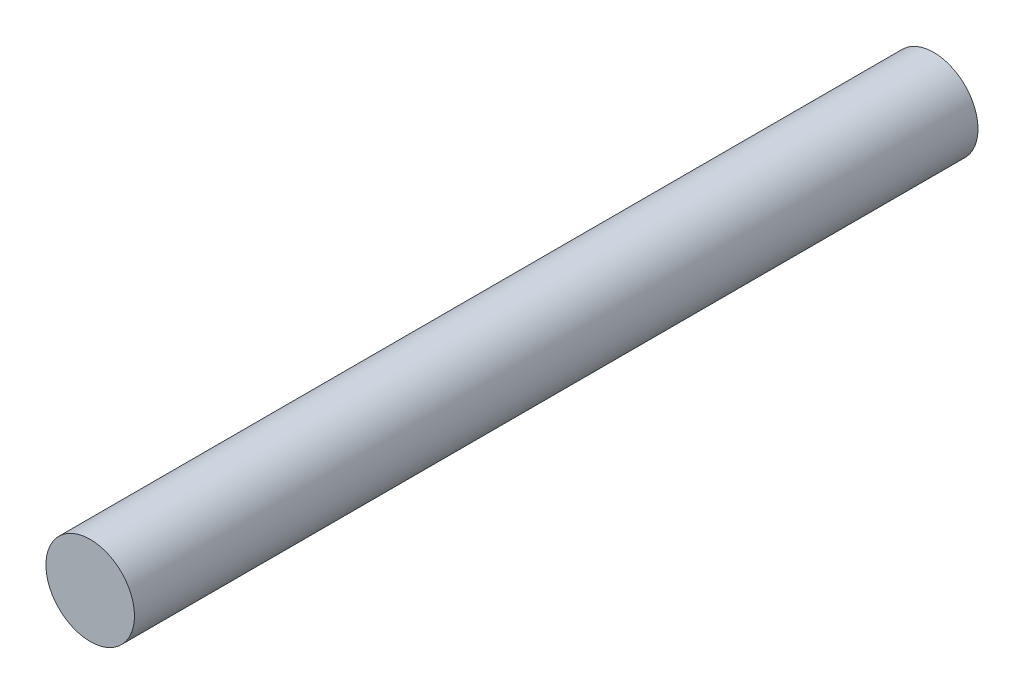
ISO-10303-21;
HEADER;
FILE_DESCRIPTION(('STEP AP214'),'2;1');
FILE_NAME('part.step','',(''),(''),'','','');
FILE_SCHEMA(('AUTOMOTIVE_DESIGN { 1 0 10303 214 1 1 1 1 }'));
ENDSEC;
DATA;
#1=APPLICATION_CONTEXT('core data for automotive mechanical design processes');
#2=APPLICATION_PROTOCOL_DEFINITION('international standard','automotive_design',2000,#1);
#3=PRODUCT_CONTEXT('',#1,'mechanical');
#4=PRODUCT('Part','Part','',(#3));
#5=PRODUCT_RELATED_PRODUCT_CATEGORY('part','',(#4));
#6=PRODUCT_DEFINITION_FORMATION('','',#4);
#7=PRODUCT_DEFINITION_CONTEXT('part definition',#1,'design');
#8=PRODUCT_DEFINITION('design','',#6,#7);
#9=PRODUCT_DEFINITION_SHAPE('','',#8);
#10=(LENGTH_UNIT() NAMED_UNIT(*) SI_UNIT(.MILLI.,.METRE.));
#11=(NAMED_UNIT(*) PLANE_ANGLE_UNIT() SI_UNIT($,.RADIAN.));
#12=(NAMED_UNIT(*) SI_UNIT($,.STERADIAN.) SOLID_ANGLE_UNIT());
#13=UNCERTAINTY_MEASURE_WITH_UNIT(LENGTH_MEASURE(1.E-05),#10,'distance_accuracy_value','');
#14=(GEOMETRIC_REPRESENTATION_CONTEXT(3) GLOBAL_UNCERTAINTY_ASSIGNED_CONTEXT((#13)) GLOBAL_UNIT_ASSIGNED_CONTEXT((#10,
#11,#12)) REPRESENTATION_CONTEXT('',''));
#15=CARTESIAN_POINT('',(0.,0.,0.));
#16=DIRECTION('',(0.,0.,1.));
#17=DIRECTION('',(1.,0.,0.));
#18=AXIS2_PLACEMENT_3D('',#15,#16,#17);
#19=CARTESIAN_POINT('',(0.,0.,1000.));
#20=DIRECTION('',(0.,0.,-1.));
#21=DIRECTION('',(-1.,0.,0.));
#22=AXIS2_PLACEMENT_3D('',#19,#20,#21);
#23=CYLINDRICAL_SURFACE('',#22,52.5);
#24=CARTESIAN_POINT('',(0.,0.,1000.));
#25=DIRECTION('',(0.,0.,1.));
#26=DIRECTION('',(1.,0.,0.));
#27=AXIS2_PLACEMENT_3D('',#24,#25,#26);
#28=CIRCLE('',#27,52.5);
#29=CARTESIAN_POINT('',(52.5,0.,1000.));
#30=VERTEX_POINT('',#29);
#31=EDGE_CURVE('E10',#30,#30,#28,.T.);
#32=ORIENTED_EDGE('',*,*,#31,.F.);
#33=EDGE_LOOP('',(#32));
#34=FACE_BOUND('',#33,.T.);
#35=CARTESIAN_POINT('',(0.,0.,0.));
#36=DIRECTION('',(0.,0.,1.));
#37=DIRECTION('',(1.,0.,0.));
#38=AXIS2_PLACEMENT_3D('',#35,#36,#37);
#39=CIRCLE('',#38,52.5);
#40=CARTESIAN_POINT('',(52.5,0.,0.));
#41=VERTEX_POINT('',#40);
#42=EDGE_CURVE('E34',#41,#41,#39,.T.);
#43=ORIENTED_EDGE('',*,*,#42,.T.);
#44=EDGE_LOOP('',(#43));
#45=FACE_BOUND('',#44,.T.);
#46=ADVANCED_FACE('F31',(#34,#45),#23,.T.);
#47=CARTESIAN_POINT('',(0.,0.,1000.));
#48=DIRECTION('',(0.,0.,1.));
#49=DIRECTION('',(1.,0.,0.));
#50=AXIS2_PLACEMENT_3D('',#47,#48,#49);
#51=PLANE('',#50);
#52=ORIENTED_EDGE('',*,*,#31,.T.);
#53=EDGE_LOOP('',(#52));
#54=FACE_BOUND('',#53,.T.);
#55=ADVANCED_FACE('F46',(#54),#51,.T.);
#56=CARTESIAN_POINT('',(0.,0.,0.));
#57=DIRECTION('',(0.,0.,1.));
#58=DIRECTION('',(1.,0.,0.));
#59=AXIS2_PLACEMENT_3D('',#56,#57,#58);
#60=PLANE('',#59);
#61=ORIENTED_EDGE('',*,*,#42,.F.);
#62=EDGE_LOOP('',(#61));
#63=FACE_BOUND('',#62,.T.);
#64=ADVANCED_FACE('F44',(#63),#60,.F.);
#65=CLOSED_SHELL('',(#46,#55,#64));
#66=MANIFOLD_SOLID_BREP('B2',#65);
#67=ADVANCED_BREP_SHAPE_REPRESENTATION('',(#18,#66),#14);
#68=SHAPE_DEFINITION_REPRESENTATION(#9,#67);
ENDSEC;
END-ISO-10303-21;
